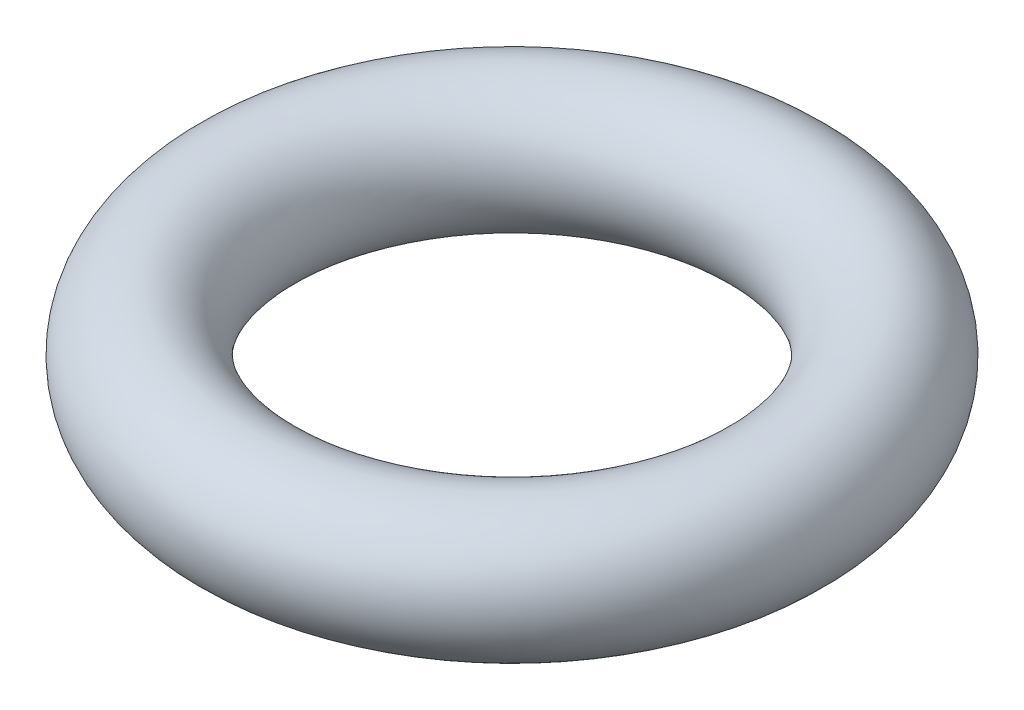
from build123d import *

# Parameters (mm, degrees)
SKETCH1_R = 0.5


with BuildPart() as part:
    # Sketch1 → Revolve1 (revolve)
    with BuildSketch(Plane.XY, mode=Mode.PRIVATE) as revolve1_sk:
        with Locations((-2, 0)):
            Circle(SKETCH1_R)
    revolve(revolve1_sk.sketch.rotate(Axis((0, 0, 0), (0, 1, 0)), 270), axis=Axis((0, 0, 0), (0, 1, 0)))


solid = part.part
